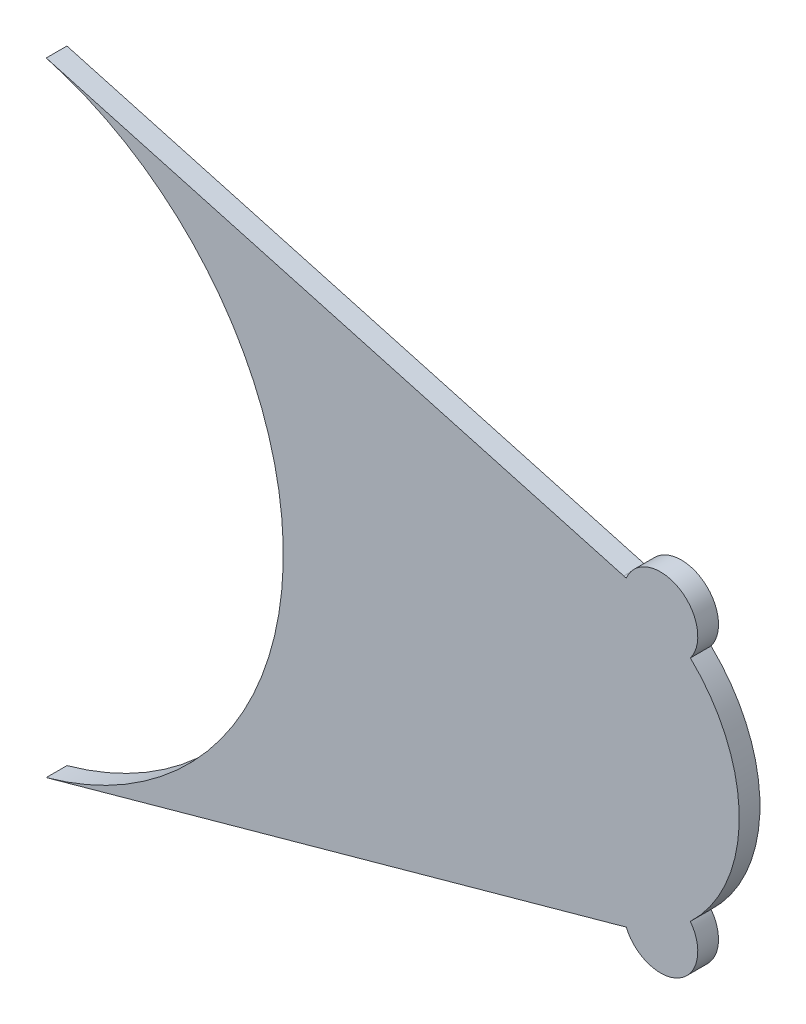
ISO-10303-21;
HEADER;
FILE_DESCRIPTION(('STEP AP214'),'2;1');
FILE_NAME('part.step','',(''),(''),'','','');
FILE_SCHEMA(('AUTOMOTIVE_DESIGN { 1 0 10303 214 1 1 1 1 }'));
ENDSEC;
DATA;
#1=APPLICATION_CONTEXT('core data for automotive mechanical design processes');
#2=APPLICATION_PROTOCOL_DEFINITION('international standard','automotive_design',2000,#1);
#3=PRODUCT_CONTEXT('',#1,'mechanical');
#4=PRODUCT('Part','Part','',(#3));
#5=PRODUCT_RELATED_PRODUCT_CATEGORY('part','',(#4));
#6=PRODUCT_DEFINITION_FORMATION('','',#4);
#7=PRODUCT_DEFINITION_CONTEXT('part definition',#1,'design');
#8=PRODUCT_DEFINITION('design','',#6,#7);
#9=PRODUCT_DEFINITION_SHAPE('','',#8);
#10=(LENGTH_UNIT() NAMED_UNIT(*) SI_UNIT(.MILLI.,.METRE.));
#11=(NAMED_UNIT(*) PLANE_ANGLE_UNIT() SI_UNIT($,.RADIAN.));
#12=(NAMED_UNIT(*) SI_UNIT($,.STERADIAN.) SOLID_ANGLE_UNIT());
#13=UNCERTAINTY_MEASURE_WITH_UNIT(LENGTH_MEASURE(1.E-05),#10,'distance_accuracy_value','');
#14=(GEOMETRIC_REPRESENTATION_CONTEXT(3) GLOBAL_UNCERTAINTY_ASSIGNED_CONTEXT((#13)) GLOBAL_UNIT_ASSIGNED_CONTEXT((#10,
#11,#12)) REPRESENTATION_CONTEXT('',''));
#15=CARTESIAN_POINT('',(0.,0.,0.));
#16=DIRECTION('',(0.,0.,1.));
#17=DIRECTION('',(1.,0.,0.));
#18=AXIS2_PLACEMENT_3D('',#15,#16,#17);
#19=CARTESIAN_POINT('',(75.,0.,2.5));
#20=DIRECTION('',(0.,0.,-1.));
#21=DIRECTION('',(-1.,0.,0.));
#22=AXIS2_PLACEMENT_3D('',#19,#20,#21);
#23=CYLINDRICAL_SURFACE('',#22,19.);
#24=CARTESIAN_POINT('',(75.,0.,0.));
#25=DIRECTION('',(0.,0.,1.));
#26=DIRECTION('',(1.,0.,0.));
#27=AXIS2_PLACEMENT_3D('',#24,#25,#26);
#28=CIRCLE('',#27,19.);
#29=CARTESIAN_POINT('',(80.3638604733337,18.2271501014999,0.));
#30=VERTEX_POINT('',#29);
#31=CARTESIAN_POINT('',(80.0666666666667,18.3119875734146,0.));
#32=VERTEX_POINT('',#31);
#33=EDGE_CURVE('E127',#30,#32,#28,.T.);
#34=ORIENTED_EDGE('',*,*,#33,.T.);
#35=DIRECTION('',(0.,0.,-1.));
#36=VECTOR('',#35,1.);
#37=CARTESIAN_POINT('',(80.0666666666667,18.3119875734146,2.5));
#38=LINE('',#37,#36);
#39=CARTESIAN_POINT('',(80.0666666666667,18.3119875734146,2.5));
#40=VERTEX_POINT('',#39);
#41=EDGE_CURVE('E11',#40,#32,#38,.T.);
#42=ORIENTED_EDGE('',*,*,#41,.F.);
#43=CARTESIAN_POINT('',(75.,0.,2.5));
#44=DIRECTION('',(0.,0.,1.));
#45=DIRECTION('',(1.,0.,0.));
#46=AXIS2_PLACEMENT_3D('',#43,#44,#45);
#47=CIRCLE('',#46,19.);
#48=CARTESIAN_POINT('',(80.3638604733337,18.2271501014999,2.5));
#49=VERTEX_POINT('',#48);
#50=EDGE_CURVE('E141',#49,#40,#47,.T.);
#51=ORIENTED_EDGE('',*,*,#50,.F.);
#52=DIRECTION('',(0.,0.,-1.));
#53=VECTOR('',#52,1.);
#54=CARTESIAN_POINT('',(80.3638604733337,18.2271501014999,2.5));
#55=LINE('',#54,#53);
#56=EDGE_CURVE('E123',#49,#30,#55,.T.);
#57=ORIENTED_EDGE('',*,*,#56,.T.);
#58=EDGE_LOOP('',(#34,#42,#51,#57));
#59=FACE_BOUND('',#58,.T.);
#60=ADVANCED_FACE('F31',(#59),#23,.T.);
#61=CARTESIAN_POINT('',(10.4,37.5877639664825,2.5));
#62=DIRECTION('',(-0.266666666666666,-0.963788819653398,0.));
#63=DIRECTION('',(0.963788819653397,-0.266666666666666,0.));
#64=AXIS2_PLACEMENT_3D('',#61,#62,#63);
#65=PLANE('',#64);
#66=DIRECTION('',(-0.963788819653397,0.266666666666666,0.));
#67=VECTOR('',#66,1.);
#68=CARTESIAN_POINT('',(10.4,37.5877639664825,0.));
#69=LINE('',#68,#67);
#70=CARTESIAN_POINT('',(10.4,37.5877639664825,0.));
#71=VERTEX_POINT('',#70);
#72=EDGE_CURVE('E130',#32,#71,#69,.T.);
#73=ORIENTED_EDGE('',*,*,#72,.T.);
#74=DIRECTION('',(0.,0.,-1.));
#75=VECTOR('',#74,1.);
#76=CARTESIAN_POINT('',(10.4,37.5877639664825,2.5));
#77=LINE('',#76,#75);
#78=CARTESIAN_POINT('',(10.4,37.5877639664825,2.5));
#79=VERTEX_POINT('',#78);
#80=EDGE_CURVE('E39',#79,#71,#77,.T.);
#81=ORIENTED_EDGE('',*,*,#80,.F.);
#82=DIRECTION('',(-0.963788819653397,0.266666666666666,0.));
#83=VECTOR('',#82,1.);
#84=CARTESIAN_POINT('',(10.4,37.5877639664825,2.5));
#85=LINE('',#84,#83);
#86=EDGE_CURVE('E90',#40,#79,#85,.T.);
#87=ORIENTED_EDGE('',*,*,#86,.F.);
#88=ORIENTED_EDGE('',*,*,#41,.T.);
#89=EDGE_LOOP('',(#73,#81,#87,#88));
#90=FACE_BOUND('',#89,.T.);
#91=ADVANCED_FACE('F176',(#90),#65,.F.);
#92=CARTESIAN_POINT('',(0.,0.,2.5));
#93=DIRECTION('',(0.,0.,-1.));
#94=DIRECTION('',(-1.,0.,0.));
#95=AXIS2_PLACEMENT_3D('',#92,#93,#94);
#96=CYLINDRICAL_SURFACE('',#95,39.);
#97=CARTESIAN_POINT('',(0.,0.,0.));
#98=DIRECTION('',(0.,0.,-1.));
#99=DIRECTION('',(-1.,0.,0.));
#100=AXIS2_PLACEMENT_3D('',#97,#98,#99);
#101=CIRCLE('',#100,39.);
#102=CARTESIAN_POINT('',(10.4,-37.5877639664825,0.));
#103=VERTEX_POINT('',#102);
#104=EDGE_CURVE('E132',#71,#103,#101,.T.);
#105=ORIENTED_EDGE('',*,*,#104,.T.);
#106=DIRECTION('',(0.,0.,-1.));
#107=VECTOR('',#106,1.);
#108=CARTESIAN_POINT('',(10.4,-37.5877639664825,2.5));
#109=LINE('',#108,#107);
#110=CARTESIAN_POINT('',(10.4,-37.5877639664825,2.5));
#111=VERTEX_POINT('',#110);
#112=EDGE_CURVE('E148',#111,#103,#109,.T.);
#113=ORIENTED_EDGE('',*,*,#112,.F.);
#114=CARTESIAN_POINT('',(0.,0.,2.5));
#115=DIRECTION('',(0.,0.,-1.));
#116=DIRECTION('',(-1.,0.,0.));
#117=AXIS2_PLACEMENT_3D('',#114,#115,#116);
#118=CIRCLE('',#117,39.);
#119=EDGE_CURVE('E156',#79,#111,#118,.T.);
#120=ORIENTED_EDGE('',*,*,#119,.F.);
#121=ORIENTED_EDGE('',*,*,#80,.T.);
#122=EDGE_LOOP('',(#105,#113,#120,#121));
#123=FACE_BOUND('',#122,.T.);
#124=ADVANCED_FACE('F154',(#123),#96,.F.);
#125=CARTESIAN_POINT('',(10.4,-37.5877639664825,2.5));
#126=DIRECTION('',(-0.266666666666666,0.963788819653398,0.));
#127=DIRECTION('',(-0.963788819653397,-0.266666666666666,0.));
#128=AXIS2_PLACEMENT_3D('',#125,#126,#127);
#129=PLANE('',#128);
#130=DIRECTION('',(0.963788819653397,0.266666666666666,0.));
#131=VECTOR('',#130,1.);
#132=CARTESIAN_POINT('',(10.4,-37.5877639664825,0.));
#133=LINE('',#132,#131);
#134=CARTESIAN_POINT('',(80.0666666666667,-18.3119875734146,0.));
#135=VERTEX_POINT('',#134);
#136=EDGE_CURVE('E134',#103,#135,#133,.T.);
#137=ORIENTED_EDGE('',*,*,#136,.T.);
#138=DIRECTION('',(0.,0.,-1.));
#139=VECTOR('',#138,1.);
#140=CARTESIAN_POINT('',(80.0666666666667,-18.3119875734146,2.5));
#141=LINE('',#140,#139);
#142=CARTESIAN_POINT('',(80.0666666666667,-18.3119875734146,2.5));
#143=VERTEX_POINT('',#142);
#144=EDGE_CURVE('E145',#143,#135,#141,.T.);
#145=ORIENTED_EDGE('',*,*,#144,.F.);
#146=DIRECTION('',(0.963788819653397,0.266666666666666,0.));
#147=VECTOR('',#146,1.);
#148=CARTESIAN_POINT('',(10.4,-37.5877639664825,2.5));
#149=LINE('',#148,#147);
#150=EDGE_CURVE('E168',#111,#143,#149,.T.);
#151=ORIENTED_EDGE('',*,*,#150,.F.);
#152=ORIENTED_EDGE('',*,*,#112,.T.);
#153=EDGE_LOOP('',(#137,#145,#151,#152));
#154=FACE_BOUND('',#153,.T.);
#155=ADVANCED_FACE('F164',(#154),#129,.F.);
#156=CARTESIAN_POINT('',(75.,0.,2.5));
#157=DIRECTION('',(0.,0.,-1.));
#158=DIRECTION('',(-1.,0.,0.));
#159=AXIS2_PLACEMENT_3D('',#156,#157,#158);
#160=CYLINDRICAL_SURFACE('',#159,19.);
#161=CARTESIAN_POINT('',(75.,0.,0.));
#162=DIRECTION('',(0.,0.,1.));
#163=DIRECTION('',(1.,0.,0.));
#164=AXIS2_PLACEMENT_3D('',#161,#162,#163);
#165=CIRCLE('',#164,19.);
#166=CARTESIAN_POINT('',(80.3638604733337,-18.2271501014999,0.));
#167=VERTEX_POINT('',#166);
#168=EDGE_CURVE('E136',#135,#167,#165,.T.);
#169=ORIENTED_EDGE('',*,*,#168,.T.);
#170=DIRECTION('',(0.,0.,-1.));
#171=VECTOR('',#170,1.);
#172=CARTESIAN_POINT('',(80.3638604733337,-18.2271501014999,2.5));
#173=LINE('',#172,#171);
#174=CARTESIAN_POINT('',(80.3638604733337,-18.2271501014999,2.5));
#175=VERTEX_POINT('',#174);
#176=EDGE_CURVE('E118',#175,#167,#173,.T.);
#177=ORIENTED_EDGE('',*,*,#176,.F.);
#178=CARTESIAN_POINT('',(75.,0.,2.5));
#179=DIRECTION('',(0.,0.,1.));
#180=DIRECTION('',(1.,0.,0.));
#181=AXIS2_PLACEMENT_3D('',#178,#179,#180);
#182=CIRCLE('',#181,19.);
#183=EDGE_CURVE('E109',#143,#175,#182,.T.);
#184=ORIENTED_EDGE('',*,*,#183,.F.);
#185=ORIENTED_EDGE('',*,*,#144,.T.);
#186=EDGE_LOOP('',(#169,#177,#184,#185));
#187=FACE_BOUND('',#186,.T.);
#188=ADVANCED_FACE('F167',(#187),#160,.T.);
#189=CARTESIAN_POINT('',(84.5,-16.4544826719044,2.5));
#190=DIRECTION('',(0.,0.,-1.));
#191=DIRECTION('',(-1.,0.,0.));
#192=AXIS2_PLACEMENT_3D('',#189,#190,#191);
#193=CYLINDRICAL_SURFACE('',#192,4.5);
#194=CARTESIAN_POINT('',(84.5,-16.4544826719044,0.));
#195=DIRECTION('',(0.,0.,1.));
#196=DIRECTION('',(1.,0.,0.));
#197=AXIS2_PLACEMENT_3D('',#194,#195,#196);
#198=CIRCLE('',#197,4.5);
#199=CARTESIAN_POINT('',(88.1032447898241,-13.7588144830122,0.));
#200=VERTEX_POINT('',#199);
#201=EDGE_CURVE('E117',#167,#200,#198,.T.);
#202=ORIENTED_EDGE('',*,*,#201,.T.);
#203=DIRECTION('',(0.,0.,-1.));
#204=VECTOR('',#203,1.);
#205=CARTESIAN_POINT('',(88.1032447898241,-13.7588144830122,2.5));
#206=LINE('',#205,#204);
#207=CARTESIAN_POINT('',(88.1032447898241,-13.7588144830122,2.5));
#208=VERTEX_POINT('',#207);
#209=EDGE_CURVE('E114',#208,#200,#206,.T.);
#210=ORIENTED_EDGE('',*,*,#209,.F.);
#211=CARTESIAN_POINT('',(84.5,-16.4544826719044,2.5));
#212=DIRECTION('',(0.,0.,1.));
#213=DIRECTION('',(1.,0.,0.));
#214=AXIS2_PLACEMENT_3D('',#211,#212,#213);
#215=CIRCLE('',#214,4.5);
#216=EDGE_CURVE('E103',#175,#208,#215,.T.);
#217=ORIENTED_EDGE('',*,*,#216,.F.);
#218=ORIENTED_EDGE('',*,*,#176,.T.);
#219=EDGE_LOOP('',(#202,#210,#217,#218));
#220=FACE_BOUND('',#219,.T.);
#221=ADVANCED_FACE('F115',(#220),#193,.T.);
#222=CARTESIAN_POINT('',(75.,0.,2.5));
#223=DIRECTION('',(0.,0.,-1.));
#224=DIRECTION('',(-1.,0.,0.));
#225=AXIS2_PLACEMENT_3D('',#222,#223,#224);
#226=CYLINDRICAL_SURFACE('',#225,19.);
#227=CARTESIAN_POINT('',(75.,0.,0.));
#228=DIRECTION('',(0.,0.,1.));
#229=DIRECTION('',(1.,0.,0.));
#230=AXIS2_PLACEMENT_3D('',#227,#228,#229);
#231=CIRCLE('',#230,19.);
#232=CARTESIAN_POINT('',(88.1032447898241,13.7588144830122,0.));
#233=VERTEX_POINT('',#232);
#234=EDGE_CURVE('E76',#200,#233,#231,.T.);
#235=ORIENTED_EDGE('',*,*,#234,.T.);
#236=DIRECTION('',(0.,0.,-1.));
#237=VECTOR('',#236,1.);
#238=CARTESIAN_POINT('',(88.1032447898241,13.7588144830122,2.5));
#239=LINE('',#238,#237);
#240=CARTESIAN_POINT('',(88.1032447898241,13.7588144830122,2.5));
#241=VERTEX_POINT('',#240);
#242=EDGE_CURVE('E119',#241,#233,#239,.T.);
#243=ORIENTED_EDGE('',*,*,#242,.F.);
#244=CARTESIAN_POINT('',(75.,0.,2.5));
#245=DIRECTION('',(0.,0.,1.));
#246=DIRECTION('',(1.,0.,0.));
#247=AXIS2_PLACEMENT_3D('',#244,#245,#246);
#248=CIRCLE('',#247,19.);
#249=EDGE_CURVE('E107',#208,#241,#248,.T.);
#250=ORIENTED_EDGE('',*,*,#249,.F.);
#251=ORIENTED_EDGE('',*,*,#209,.T.);
#252=EDGE_LOOP('',(#235,#243,#250,#251));
#253=FACE_BOUND('',#252,.T.);
#254=ADVANCED_FACE('F121',(#253),#226,.T.);
#255=CARTESIAN_POINT('',(84.4999999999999,16.4544826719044,2.5));
#256=DIRECTION('',(0.,0.,-1.));
#257=DIRECTION('',(-1.,0.,0.));
#258=AXIS2_PLACEMENT_3D('',#255,#256,#257);
#259=CYLINDRICAL_SURFACE('',#258,4.5);
#260=CARTESIAN_POINT('',(84.4999999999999,16.4544826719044,0.));
#261=DIRECTION('',(0.,0.,1.));
#262=DIRECTION('',(1.,0.,0.));
#263=AXIS2_PLACEMENT_3D('',#260,#261,#262);
#264=CIRCLE('',#263,4.5);
#265=EDGE_CURVE('E82',#233,#30,#264,.T.);
#266=ORIENTED_EDGE('',*,*,#265,.T.);
#267=ORIENTED_EDGE('',*,*,#56,.F.);
#268=CARTESIAN_POINT('',(84.4999999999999,16.4544826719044,2.5));
#269=DIRECTION('',(0.,0.,1.));
#270=DIRECTION('',(1.,0.,0.));
#271=AXIS2_PLACEMENT_3D('',#268,#269,#270);
#272=CIRCLE('',#271,4.5);
#273=EDGE_CURVE('E47',#241,#49,#272,.T.);
#274=ORIENTED_EDGE('',*,*,#273,.F.);
#275=ORIENTED_EDGE('',*,*,#242,.T.);
#276=EDGE_LOOP('',(#266,#267,#274,#275));
#277=FACE_BOUND('',#276,.T.);
#278=ADVANCED_FACE('F192',(#277),#259,.T.);
#279=CARTESIAN_POINT('',(75.,0.,2.5));
#280=DIRECTION('',(0.,0.,1.));
#281=DIRECTION('',(1.,0.,0.));
#282=AXIS2_PLACEMENT_3D('',#279,#280,#281);
#283=PLANE('',#282);
#284=ORIENTED_EDGE('',*,*,#50,.T.);
#285=ORIENTED_EDGE('',*,*,#86,.T.);
#286=ORIENTED_EDGE('',*,*,#119,.T.);
#287=ORIENTED_EDGE('',*,*,#150,.T.);
#288=ORIENTED_EDGE('',*,*,#183,.T.);
#289=ORIENTED_EDGE('',*,*,#216,.T.);
#290=ORIENTED_EDGE('',*,*,#249,.T.);
#291=ORIENTED_EDGE('',*,*,#273,.T.);
#292=EDGE_LOOP('',(#284,#285,#286,#287,#288,#289,#290,#291));
#293=FACE_BOUND('',#292,.T.);
#294=ADVANCED_FACE('F105',(#293),#283,.T.);
#295=CARTESIAN_POINT('',(75.,0.,0.));
#296=DIRECTION('',(0.,0.,1.));
#297=DIRECTION('',(1.,0.,0.));
#298=AXIS2_PLACEMENT_3D('',#295,#296,#297);
#299=PLANE('',#298);
#300=ORIENTED_EDGE('',*,*,#33,.F.);
#301=ORIENTED_EDGE('',*,*,#265,.F.);
#302=ORIENTED_EDGE('',*,*,#234,.F.);
#303=ORIENTED_EDGE('',*,*,#201,.F.);
#304=ORIENTED_EDGE('',*,*,#168,.F.);
#305=ORIENTED_EDGE('',*,*,#136,.F.);
#306=ORIENTED_EDGE('',*,*,#104,.F.);
#307=ORIENTED_EDGE('',*,*,#72,.F.);
#308=EDGE_LOOP('',(#300,#301,#302,#303,#304,#305,#306,#307));
#309=FACE_BOUND('',#308,.T.);
#310=ADVANCED_FACE('F160',(#309),#299,.F.);
#311=CLOSED_SHELL('',(#60,#91,#124,#155,#188,#221,#254,#278,#294,#310));
#312=MANIFOLD_SOLID_BREP('B2',#311);
#313=ADVANCED_BREP_SHAPE_REPRESENTATION('',(#18,#312),#14);
#314=SHAPE_DEFINITION_REPRESENTATION(#9,#313);
ENDSEC;
END-ISO-10303-21;
